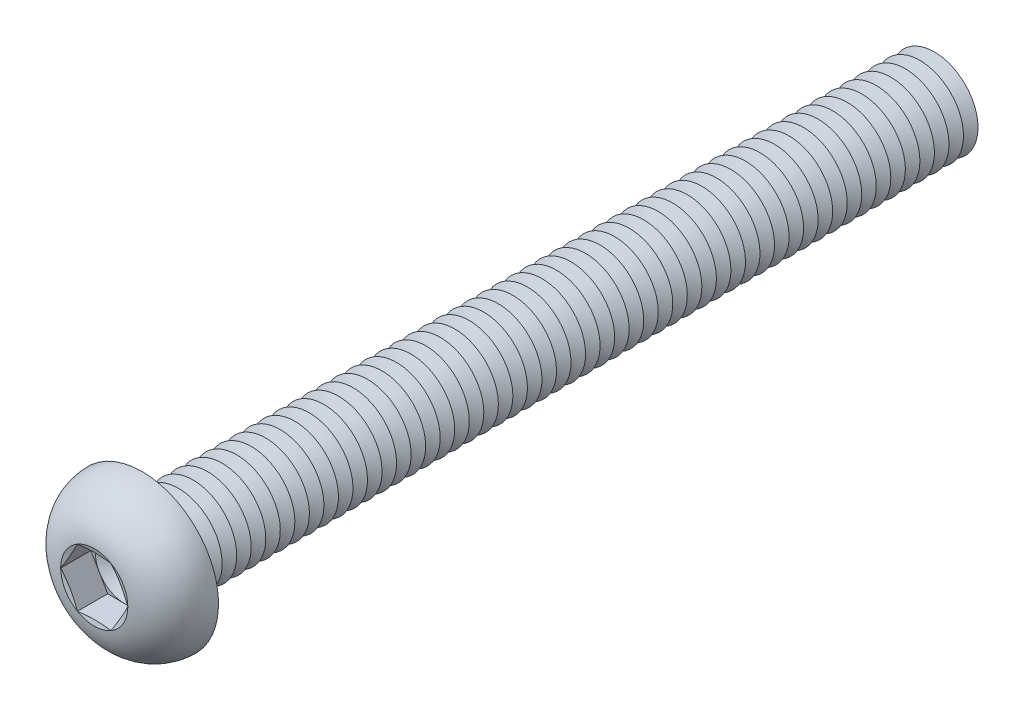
from build123d import *

# Parameters (mm, degrees)
FILLET1_R          = 0.5
LPATTERN1_COUNT    = 55
LPATTERN1_PITCH    = 1
CUT_EXTRUDE1_DEPTH = 2.08


with BuildPart() as part:
    # Sketch1 → Revolve1 (revolve)
    with BuildSketch(Plane(origin=(0, 0, 0), x_dir=(0, 0, -1), z_dir=(1, 0, 0))):
        with BuildLine():
            Line((0, 3), (0, 5.25))
            ThreePointArc((0, 5.25), (-2.210041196, 4.408189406), (-3.3, 2.3094))
            Line((-3.3, 2.3094), (-2.990599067, 1.1547))
            Line((-2.990599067, 1.1547), (-3.3, 1.1547))
            Line((-3.3, 1.1547), (-3.3, 0))
            Line((-3.3, 0), (55, 0))
            Line((55, 0), (55, 3))
            Line((55, 3), (0, 3))
        make_face()
    revolve(axis=Axis((0, 0, -55), (0, 0, 1)))

    # Fillet1
    fillet1_edges = [part.edges().sort_by_distance(p)[0] for p in [
        (0, -3, 0),
    ]]
    fillet(fillet1_edges, radius=FILLET1_R)

    # Sketch2 → Cut-Revolve1 (revolve, cut)
    with BuildSketch(Plane(origin=(0, 0, 0), x_dir=(0, 0, -1), z_dir=(1, 0, 0))):
        Polygon((54.5, 3), (55.5, 3), (55, 2.133974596), align=None)
    cut_revolve1 = revolve(axis=Axis((0, 0, -55), (0, 0, -1)), mode=Mode.SUBTRACT)

    # LPattern1: Cut-Revolve1 ×55
    with Locations(*[(0, 0, i * LPATTERN1_PITCH) for i in range(1, LPATTERN1_COUNT)]):
        add(cut_revolve1, mode=Mode.SUBTRACT)

    # Sketch3 → Cut-Extrude1 (cut)
    with BuildSketch(Plane.XY.offset(3.3)):
        Polygon((1.1547, 1.999999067), (-1.1547, 1.999999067), (-2.3094, 0), (-1.1547, -1.999999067), (1.1547, -1.999999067), (2.3094, 0), align=None)
    extrude(amount=-CUT_EXTRUDE1_DEPTH, mode=Mode.SUBTRACT)

    # Cut-Extrude2 cone 1 section (on through the dimple's axis) → Cut-Extrude2 (revolve, cut)
    with BuildSketch(Plane(origin=(0, 0, 1.22), x_dir=(0, -1, 0), z_dir=(1, 0, 0))):
        Polygon((0, 0), (1.999999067, 0), (0, 1.1547), align=None)
    revolve(axis=Axis((0, 0, 1.22), (0, 0, -1)), mode=Mode.SUBTRACT)


solid = part.part
